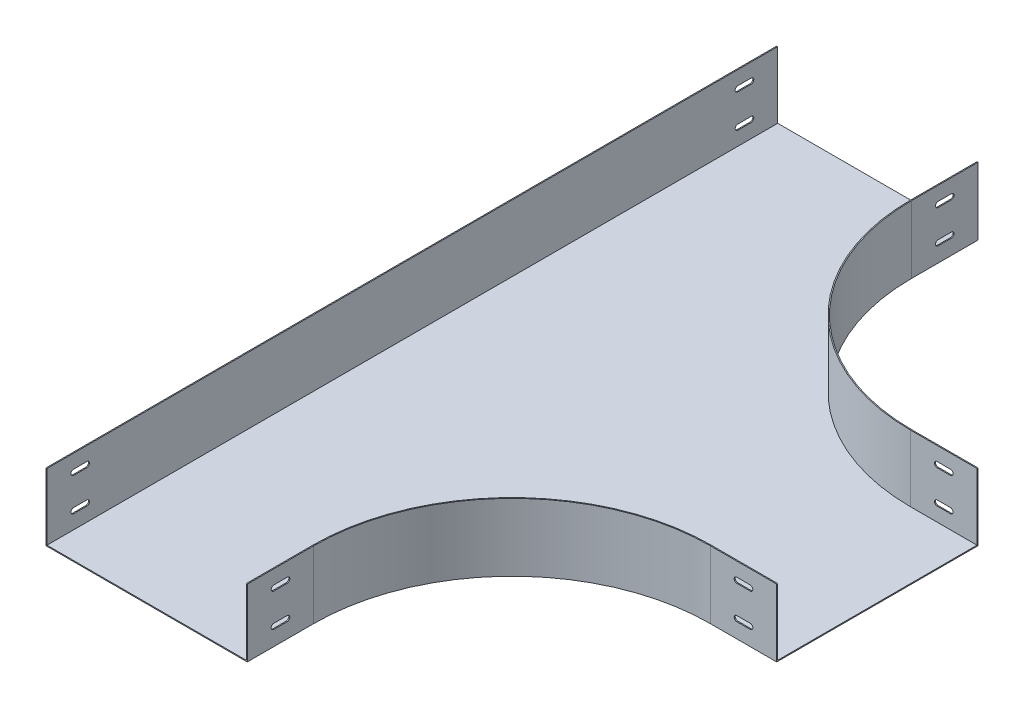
from build123d import *

# Parameters (mm, degrees)
BOSS_EXTRUDE1_DEPTH      = 1.5
EXTRUDE_THIN1_DEPTH      = 100
EXTRUDE_THIN1_DEPTH_BACK = 1.5
SKETCH2_W                = 1.5
SKETCH2_H                = 1100
CUT_EXTRUDE1_DEPTH       = 785.219357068
CUT_EXTRUDE1_DEPTH_BACK  = 785.219357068
CUT_EXTRUDE2_DEPTH       = 785.219357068
CUT_EXTRUDE2_DEPTH_BACK  = 785.219357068


with BuildPart() as part:
    # Sketch1 → Boss-Extrude1 (new body)
    with BuildSketch(Plane(origin=(0, 0, 0), x_dir=(1, 0, 0), z_dir=(0, 1, 0))):
        with BuildLine():
            Line((-150, 550), (150, 550))
            Line((150, 550), (150, 450))
            ThreePointArc((150, 450), (237.867965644, 237.867965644), (450, 150))
            Line((450, 150), (550, 150))
            Line((550, 150), (550, -150))
            Line((550, -150), (450, -150))
            ThreePointArc((450, -150), (237.867965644, -237.867965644), (150, -450))
            Line((150, -450), (150, -550))
            Line((150, -550), (-150, -550))
            Line((-150, -550), (-150, 550))
        make_face()
    extrude(amount=-BOSS_EXTRUDE1_DEPTH)

    # Sketch2 → Extrude-Thin1 (add, two sides: drawn at the far end of the back side and taken through both)
    with BuildSketch(Plane(origin=(0, 0, 0), x_dir=(1, 0, 0), z_dir=(0, 1, 0)).offset(-EXTRUDE_THIN1_DEPTH_BACK)):
        with BuildLine():
            Line((150, -550), (150, -450))
            ThreePointArc((150, -450), (237.867965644, -237.867965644), (450, -150))
            Line((450, -150), (550, -150))
            Line((550, -150), (550, -151.5))
            Line((550, -151.5), (450, -151.5))
            ThreePointArc((450, -151.5), (238.928625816, -238.928625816), (151.5, -450))
            Line((151.5, -450), (151.5, -550))
            Line((151.5, -550), (150, -550))
        make_face()
        with Locations((-150.75, 0)):
            Rectangle(SKETCH2_W, SKETCH2_H)
        with BuildLine():
            Line((550, 150), (450, 150))
            ThreePointArc((450, 150), (237.867965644, 237.867965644), (150, 450))
            Line((150, 450), (150, 550))
            Line((150, 550), (151.5, 550))
            Line((151.5, 550), (151.5, 450))
            ThreePointArc((151.5, 450), (238.928625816, 238.928625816), (450, 151.5))
            Line((450, 151.5), (550, 151.5))
            Line((550, 151.5), (550, 150))
        make_face()
    extrude(amount=EXTRUDE_THIN1_DEPTH + EXTRUDE_THIN1_DEPTH_BACK)

    # Sketch3 → Cut-Extrude1 (cut, two sides: drawn at the far end of the back side and taken through both)
    with BuildSketch(Plane.XY.offset(-CUT_EXTRUDE1_DEPTH_BACK)):
        with BuildLine():
            Line((490, 79), (510, 79))
            ThreePointArc((510, 79), (514, 75), (510, 71))
            Line((510, 71), (490, 71))
            ThreePointArc((490, 71), (486, 75), (490, 79))
        make_face()
        with BuildLine():
            Line((490, 29), (510, 29))
            ThreePointArc((510, 29), (514, 25), (510, 21))
            Line((510, 21), (490, 21))
            ThreePointArc((490, 21), (486, 25), (490, 29))
        make_face()
    extrude(amount=CUT_EXTRUDE1_DEPTH + CUT_EXTRUDE1_DEPTH_BACK, mode=Mode.SUBTRACT)

    # Sketch4 → Cut-Extrude2 (cut, two sides: drawn at the far end of the back side and taken through both)
    with BuildSketch(Plane(origin=(0, 0, 0), x_dir=(0, 0, -1), z_dir=(1, 0, 0)).offset(-CUT_EXTRUDE2_DEPTH_BACK)):
        with BuildLine():
            Line((-510, 79), (-490, 79))
            ThreePointArc((-490, 79), (-486, 75), (-490, 71))
            Line((-490, 71), (-510, 71))
            ThreePointArc((-510, 71), (-514, 75), (-510, 79))
        make_face()
        with BuildLine():
            Line((-510, 29), (-490, 29))
            ThreePointArc((-490, 29), (-486, 25), (-490, 21))
            Line((-490, 21), (-510, 21))
            ThreePointArc((-510, 21), (-514, 25), (-510, 29))
        make_face()
        with BuildLine():
            Line((490, 79), (510, 79))
            ThreePointArc((510, 79), (514, 75), (510, 71))
            Line((510, 71), (490, 71))
            ThreePointArc((490, 71), (486, 75), (490, 79))
        make_face()
        with BuildLine():
            Line((490, 29), (510, 29))
            ThreePointArc((510, 29), (514, 25), (510, 21))
            Line((510, 21), (490, 21))
            ThreePointArc((490, 21), (486, 25), (490, 29))
        make_face()
    extrude(amount=CUT_EXTRUDE2_DEPTH + CUT_EXTRUDE2_DEPTH_BACK, mode=Mode.SUBTRACT)


solid = part.part
